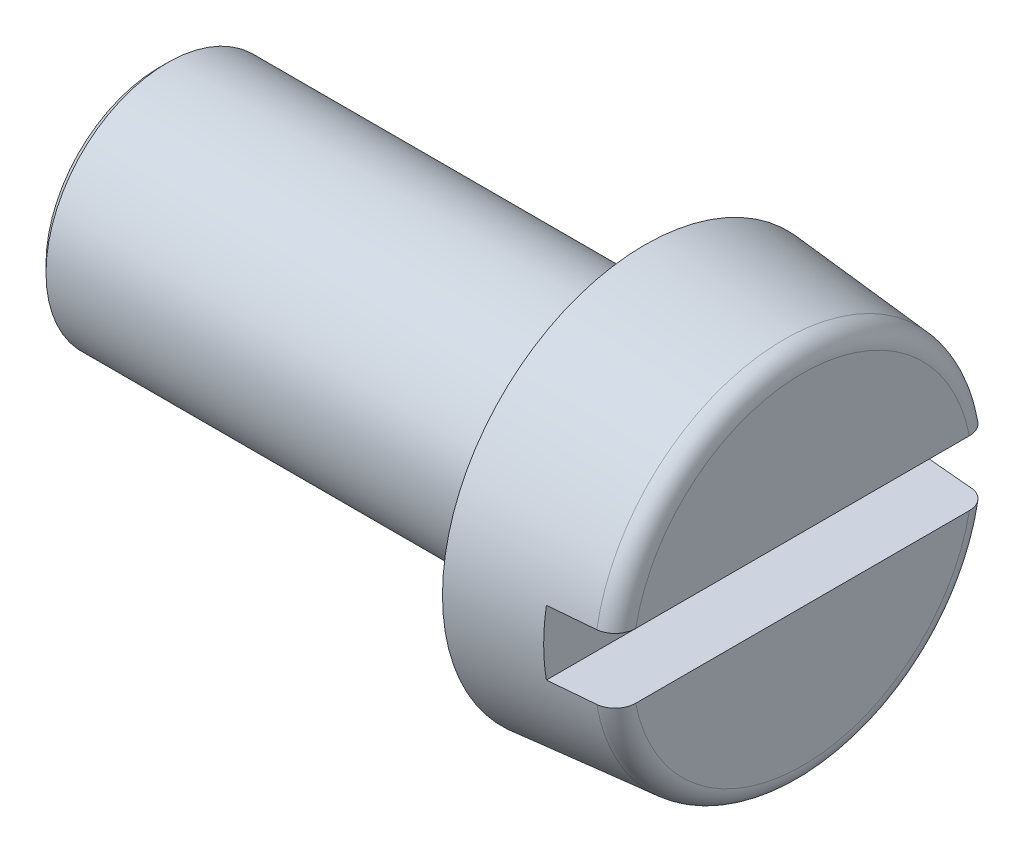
ISO-10303-21;
HEADER;
FILE_DESCRIPTION(('STEP AP214'),'2;1');
FILE_NAME('part.step','',(''),(''),'','','');
FILE_SCHEMA(('AUTOMOTIVE_DESIGN { 1 0 10303 214 1 1 1 1 }'));
ENDSEC;
DATA;
#1=APPLICATION_CONTEXT('core data for automotive mechanical design processes');
#2=APPLICATION_PROTOCOL_DEFINITION('international standard','automotive_design',2000,#1);
#3=PRODUCT_CONTEXT('',#1,'mechanical');
#4=PRODUCT('Part','Part','',(#3));
#5=PRODUCT_RELATED_PRODUCT_CATEGORY('part','',(#4));
#6=PRODUCT_DEFINITION_FORMATION('','',#4);
#7=PRODUCT_DEFINITION_CONTEXT('part definition',#1,'design');
#8=PRODUCT_DEFINITION('design','',#6,#7);
#9=PRODUCT_DEFINITION_SHAPE('','',#8);
#10=(LENGTH_UNIT() NAMED_UNIT(*) SI_UNIT(.MILLI.,.METRE.));
#11=(NAMED_UNIT(*) PLANE_ANGLE_UNIT() SI_UNIT($,.RADIAN.));
#12=(NAMED_UNIT(*) SI_UNIT($,.STERADIAN.) SOLID_ANGLE_UNIT());
#13=UNCERTAINTY_MEASURE_WITH_UNIT(LENGTH_MEASURE(1.E-05),#10,'distance_accuracy_value','');
#14=(GEOMETRIC_REPRESENTATION_CONTEXT(3) GLOBAL_UNCERTAINTY_ASSIGNED_CONTEXT((#13)) GLOBAL_UNIT_ASSIGNED_CONTEXT((#10,
#11,#12)) REPRESENTATION_CONTEXT('',''));
#15=CARTESIAN_POINT('',(0.,0.,0.));
#16=DIRECTION('',(0.,0.,1.));
#17=DIRECTION('',(1.,0.,0.));
#18=AXIS2_PLACEMENT_3D('',#15,#16,#17);
#19=CARTESIAN_POINT('',(3.9,0.,0.));
#20=DIRECTION('',(1.,0.,0.));
#21=DIRECTION('',(0.,0.,-1.));
#22=AXIS2_PLACEMENT_3D('',#19,#20,#21);
#23=PLANE('',#22);
#24=DIRECTION('',(0.,0.,1.));
#25=VECTOR('',#24,1.);
#26=CARTESIAN_POINT('',(3.9,0.799999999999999,-4.93558507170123));
#27=LINE('',#26,#25);
#28=CARTESIAN_POINT('',(3.9,0.799999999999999,-4.1237459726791));
#29=VERTEX_POINT('',#28);
#30=CARTESIAN_POINT('',(3.9,0.799999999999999,4.1237459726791));
#31=VERTEX_POINT('',#30);
#32=EDGE_CURVE('E171',#29,#31,#27,.T.);
#33=ORIENTED_EDGE('',*,*,#32,.F.);
#34=CARTESIAN_POINT('',(3.9,0.,0.));
#35=DIRECTION('',(-1.,0.,0.));
#36=DIRECTION('',(0.,0.,1.));
#37=AXIS2_PLACEMENT_3D('',#34,#35,#36);
#38=CIRCLE('',#37,4.20062862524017);
#39=EDGE_CURVE('E98',#31,#29,#38,.T.);
#40=ORIENTED_EDGE('',*,*,#39,.F.);
#41=EDGE_LOOP('',(#33,#40));
#42=FACE_BOUND('',#41,.T.);
#43=ADVANCED_FACE('F38',(#42),#23,.T.);
#44=CARTESIAN_POINT('',(3.4,0.,0.));
#45=DIRECTION('',(-1.,0.,0.));
#46=DIRECTION('',(0.,0.,1.));
#47=AXIS2_PLACEMENT_3D('',#44,#45,#46);
#48=TOROIDAL_SURFACE('',#47,4.20062862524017,0.5);
#49=CARTESIAN_POINT('',(3.52774679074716,0.799999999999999,-4.61521121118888));
#50=CARTESIAN_POINT('',(3.55476323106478,0.799999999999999,-4.60796387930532));
#51=CARTESIAN_POINT('',(3.58118338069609,0.799999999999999,-4.59841062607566));
#52=CARTESIAN_POINT('',(3.63205775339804,0.799999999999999,-4.57497961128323));
#53=CARTESIAN_POINT('',(3.65650938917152,0.799999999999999,-4.56109627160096));
#54=CARTESIAN_POINT('',(3.70271812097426,0.799999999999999,-4.52944340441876));
#55=CARTESIAN_POINT('',(3.72447787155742,0.799999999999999,-4.51167775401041));
#56=CARTESIAN_POINT('',(3.7647342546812,0.799999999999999,-4.47278291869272));
#57=CARTESIAN_POINT('',(3.78323165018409,0.799999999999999,-4.45165452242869));
#58=CARTESIAN_POINT('',(3.81665030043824,0.799999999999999,-4.40641898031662));
#59=CARTESIAN_POINT('',(3.83153509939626,0.799999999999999,-4.38228491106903));
#60=CARTESIAN_POINT('',(3.85711460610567,0.799999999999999,-4.33188938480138));
#61=CARTESIAN_POINT('',(3.86780881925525,0.799999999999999,-4.30562767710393));
#62=CARTESIAN_POINT('',(3.88487789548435,0.799999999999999,-4.25128228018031));
#63=CARTESIAN_POINT('',(3.89118229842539,0.799999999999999,-4.22317645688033));
#64=CARTESIAN_POINT('',(3.89904863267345,0.799999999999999,-4.16630862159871));
#65=CARTESIAN_POINT('',(3.90061019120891,0.799999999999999,-4.13754655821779));
#66=CARTESIAN_POINT('',(3.89895173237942,0.799999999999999,-4.07979276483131));
#67=CARTESIAN_POINT('',(3.89567054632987,0.799999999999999,-4.05080277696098));
#68=CARTESIAN_POINT('',(3.88430740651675,0.799999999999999,-3.99377829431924));
#69=CARTESIAN_POINT('',(3.87622525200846,0.799999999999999,-3.96574383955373));
#70=CARTESIAN_POINT('',(3.85543459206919,0.799999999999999,-3.91132710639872));
#71=CARTESIAN_POINT('',(3.84270933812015,0.799999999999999,-3.8849512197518));
#72=CARTESIAN_POINT('',(3.81297177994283,0.799999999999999,-3.83473620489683));
#73=CARTESIAN_POINT('',(3.7959595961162,0.799999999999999,-3.81089700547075));
#74=CARTESIAN_POINT('',(3.75828277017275,0.799999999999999,-3.76668673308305));
#75=CARTESIAN_POINT('',(3.73765369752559,0.799999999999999,-3.74628536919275));
#76=CARTESIAN_POINT('',(3.6932020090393,0.799999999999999,-3.7093212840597));
#77=CARTESIAN_POINT('',(3.66937975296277,0.799999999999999,-3.69275813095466));
#78=CARTESIAN_POINT('',(3.61972619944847,0.799999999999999,-3.66430195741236));
#79=CARTESIAN_POINT('',(3.59394475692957,0.799999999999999,-3.65232196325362));
#80=CARTESIAN_POINT('',(3.54070796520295,0.799999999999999,-3.6329662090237));
#81=CARTESIAN_POINT('',(3.51325284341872,0.799999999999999,-3.62558982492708));
#82=CARTESIAN_POINT('',(3.45806503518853,0.799999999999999,-3.61579596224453));
#83=CARTESIAN_POINT('',(3.43035013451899,0.799999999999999,-3.61327809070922));
#84=CARTESIAN_POINT('',(3.37489596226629,0.799999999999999,-3.6129804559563));
#85=CARTESIAN_POINT('',(3.34715669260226,0.799999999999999,-3.61520034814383));
#86=CARTESIAN_POINT('',(3.29271517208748,0.799999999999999,-3.62425978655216));
#87=CARTESIAN_POINT('',(3.26600559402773,0.799999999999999,-3.63105543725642));
#88=CARTESIAN_POINT('',(3.21409332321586,0.799999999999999,-3.64900145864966));
#89=CARTESIAN_POINT('',(3.18889066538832,0.799999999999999,-3.66015193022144));
#90=CARTESIAN_POINT('',(3.14049011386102,0.799999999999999,-3.68655958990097));
#91=CARTESIAN_POINT('',(3.11730892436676,0.799999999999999,-3.70184736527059));
#92=CARTESIAN_POINT('',(3.07377777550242,0.799999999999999,-3.73602702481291));
#93=CARTESIAN_POINT('',(3.05342807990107,0.799999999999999,-3.75491924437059));
#94=CARTESIAN_POINT('',(3.01570554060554,0.799999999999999,-3.7961662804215));
#95=CARTESIAN_POINT('',(2.99839942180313,0.799999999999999,-3.8185821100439));
#96=CARTESIAN_POINT('',(2.96770482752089,0.799999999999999,-3.86595197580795));
#97=CARTESIAN_POINT('',(2.95431679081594,0.799999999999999,-3.89090629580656));
#98=CARTESIAN_POINT('',(2.93155662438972,0.799999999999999,-3.94320276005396));
#99=CARTESIAN_POINT('',(2.92227362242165,0.799999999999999,-3.97058371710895));
#100=CARTESIAN_POINT('',(2.90837527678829,0.799999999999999,-4.02650622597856));
#101=CARTESIAN_POINT('',(2.90376028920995,0.799999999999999,-4.05504786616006));
#102=CARTESIAN_POINT('',(2.89929658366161,0.799999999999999,-4.11284197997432));
#103=CARTESIAN_POINT('',(2.89950473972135,0.799999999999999,-4.14209886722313));
#104=CARTESIAN_POINT('',(2.90483423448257,0.799999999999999,-4.20016284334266));
#105=CARTESIAN_POINT('',(2.90995564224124,0.799999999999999,-4.22896992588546));
#106=CARTESIAN_POINT('',(2.92498226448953,0.799999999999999,-4.2852766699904));
#107=CARTESIAN_POINT('',(2.93488232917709,0.799999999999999,-4.31277770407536));
#108=CARTESIAN_POINT('',(2.95921142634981,0.799999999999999,-4.36569898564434));
#109=CARTESIAN_POINT('',(2.97364023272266,0.799999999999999,-4.39111933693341));
#110=CARTESIAN_POINT('',(3.00644955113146,0.799999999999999,-4.4388398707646));
#111=CARTESIAN_POINT('',(3.0247829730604,0.799999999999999,-4.46117241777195));
#112=CARTESIAN_POINT('',(3.06499289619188,0.799999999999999,-4.50237965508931));
#113=CARTESIAN_POINT('',(3.08686895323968,0.799999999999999,-4.52125477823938));
#114=CARTESIAN_POINT('',(3.13316963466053,0.799999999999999,-4.55469350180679));
#115=CARTESIAN_POINT('',(3.15754817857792,0.799999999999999,-4.56932091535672));
#116=CARTESIAN_POINT('',(3.20844824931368,0.799999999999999,-4.59421207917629));
#117=CARTESIAN_POINT('',(3.23497014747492,0.799999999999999,-4.60447507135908));
#118=CARTESIAN_POINT('',(3.2890118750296,0.799999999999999,-4.62020471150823));
#119=CARTESIAN_POINT('',(3.31651363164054,0.799999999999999,-4.62573362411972));
#120=CARTESIAN_POINT('',(3.37203228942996,0.799999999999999,-4.63204846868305));
#121=CARTESIAN_POINT('',(3.40004847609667,0.799999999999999,-4.63284054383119));
#122=CARTESIAN_POINT('',(3.44476962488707,0.799999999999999,-4.63030564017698));
#123=CARTESIAN_POINT('',(3.46157366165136,0.799999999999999,-4.62848133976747));
#124=CARTESIAN_POINT('',(3.49490651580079,0.799999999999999,-4.62312194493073));
#125=CARTESIAN_POINT('',(3.51143533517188,0.799999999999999,-4.61958686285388));
#126=CARTESIAN_POINT('',(3.52774679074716,0.799999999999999,-4.61521121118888));
#127=B_SPLINE_CURVE_WITH_KNOTS('',3,(#49,#50,#51,#52,#53,#54,#55,#56,#57,#58,#59,#60,#61,#62,
#63,#64,#65,#66,#67,#68,#69,#70,#71,#72,#73,#74,#75,#76,#77,#78,#79,#80,#81,#82,#83,#84,#85,#86,
#87,#88,#89,#90,#91,#92,#93,#94,#95,#96,#97,#98,#99,#100,#101,#102,#103,#104,#105,#106,#107,
#108,#109,#110,#111,#112,#113,#114,#115,#116,#117,#118,#119,#120,#121,#122,#123,#124,#125,#126),
.UNSPECIFIED.,.T.,.F.,(4,2,2,2,2,2,2,2,2,2,2,2,2,2,2,2,2,2,2,2,2,2,2,2,2,2,2,2,2,2,2,2,2,2,2,2,
2,2,4),(0.,0.0838523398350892,0.167813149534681,0.251690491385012,0.335548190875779,
0.42021988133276,0.504901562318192,0.590912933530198,0.676931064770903,0.76404503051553,
0.851162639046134,0.938597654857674,1.02603021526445,1.11264678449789,1.19925360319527,
1.28412404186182,1.36898297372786,1.45206883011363,1.53514864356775,1.61744261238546,
1.69973848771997,1.78266023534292,1.86558970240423,1.95015690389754,2.03473357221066,
2.12106582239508,2.20740465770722,2.29476210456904,2.38212077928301,2.46938551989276,
2.55664590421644,2.64290814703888,2.72915958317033,2.8140388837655,2.89893292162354,
2.9826924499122,3.06634332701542,3.11697041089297,3.16759712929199),.UNSPECIFIED.);
#128=CARTESIAN_POINT('',(3.44357787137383,0.799999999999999,-4.63012157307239));
#129=VERTEX_POINT('',#128);
#130=EDGE_CURVE('E150',#129,#29,#127,.T.);
#131=ORIENTED_EDGE('',*,*,#130,.F.);
#132=CARTESIAN_POINT('',(3.44357787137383,0.,0.));
#133=DIRECTION('',(-1.,0.,0.));
#134=DIRECTION('',(0.,0.,1.));
#135=AXIS2_PLACEMENT_3D('',#132,#133,#134);
#136=CIRCLE('',#135,4.69872597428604);
#137=CARTESIAN_POINT('',(3.44357787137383,0.799999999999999,4.63012157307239));
#138=VERTEX_POINT('',#137);
#139=EDGE_CURVE('E110',#138,#129,#136,.T.);
#140=ORIENTED_EDGE('',*,*,#139,.F.);
#141=CARTESIAN_POINT('',(3.57254162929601,0.799999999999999,3.64457370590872));
#142=CARTESIAN_POINT('',(3.59887173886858,0.799999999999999,3.65448642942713));
#143=CARTESIAN_POINT('',(3.62437233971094,0.799999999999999,3.66666727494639));
#144=CARTESIAN_POINT('',(3.67297144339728,0.799999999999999,3.69517294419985));
#145=CARTESIAN_POINT('',(3.69606647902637,0.799999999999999,3.7115036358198));
#146=CARTESIAN_POINT('',(3.73917258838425,0.799999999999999,3.74776920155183));
#147=CARTESIAN_POINT('',(3.75918795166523,0.799999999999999,3.76769897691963));
#148=CARTESIAN_POINT('',(3.79564709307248,0.799999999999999,3.81058128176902));
#149=CARTESIAN_POINT('',(3.81209170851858,0.799999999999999,3.83353310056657));
#150=CARTESIAN_POINT('',(3.841239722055,0.799999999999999,3.88220655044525));
#151=CARTESIAN_POINT('',(3.85387844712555,0.799999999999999,3.9079669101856));
#152=CARTESIAN_POINT('',(3.87473194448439,0.799999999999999,3.96122161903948));
#153=CARTESIAN_POINT('',(3.88294611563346,0.799999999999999,3.98871620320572));
#154=CARTESIAN_POINT('',(3.89483524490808,0.799999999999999,4.04513673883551));
#155=CARTESIAN_POINT('',(3.8984345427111,0.799999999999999,4.07407865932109));
#156=CARTESIAN_POINT('',(3.90074513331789,0.799999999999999,4.13215790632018));
#157=CARTESIAN_POINT('',(3.89945623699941,0.799999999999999,4.16129524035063));
#158=CARTESIAN_POINT('',(3.89199648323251,0.799999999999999,4.21905741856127));
#159=CARTESIAN_POINT('',(3.88580628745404,0.799999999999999,4.24767977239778));
#160=CARTESIAN_POINT('',(3.86866992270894,0.799999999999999,4.30346465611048));
#161=CARTESIAN_POINT('',(3.85772390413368,0.799999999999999,4.33062723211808));
#162=CARTESIAN_POINT('',(3.8314661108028,0.799999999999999,4.38248106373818));
#163=CARTESIAN_POINT('',(3.81619000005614,0.799999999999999,4.40719036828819));
#164=CARTESIAN_POINT('',(3.7816471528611,0.799999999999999,4.45364265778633));
#165=CARTESIAN_POINT('',(3.76238071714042,0.799999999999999,4.47538586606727));
#166=CARTESIAN_POINT('',(3.72070968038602,0.799999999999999,4.51493993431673));
#167=CARTESIAN_POINT('',(3.69835612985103,0.799999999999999,4.53280457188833));
#168=CARTESIAN_POINT('',(3.65092834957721,0.799999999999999,4.56445799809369));
#169=CARTESIAN_POINT('',(3.62585436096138,0.799999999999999,4.57824714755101));
#170=CARTESIAN_POINT('',(3.57411063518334,0.799999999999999,4.60114111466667));
#171=CARTESIAN_POINT('',(3.54747112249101,0.799999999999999,4.61031426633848));
#172=CARTESIAN_POINT('',(3.49302178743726,0.799999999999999,4.62400554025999));
#173=CARTESIAN_POINT('',(3.46521204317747,0.799999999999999,4.62852397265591));
#174=CARTESIAN_POINT('',(3.40951842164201,0.799999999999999,4.63274323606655));
#175=CARTESIAN_POINT('',(3.38163825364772,0.799999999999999,4.63249317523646));
#176=CARTESIAN_POINT('',(3.32631848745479,0.799999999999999,4.62730376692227));
#177=CARTESIAN_POINT('',(3.2988788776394,0.799999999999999,4.62236454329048));
#178=CARTESIAN_POINT('',(3.24528128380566,0.799999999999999,4.60796494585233));
#179=CARTESIAN_POINT('',(3.21912051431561,0.799999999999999,4.5985149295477));
#180=CARTESIAN_POINT('',(3.16874300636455,0.799999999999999,4.57538334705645));
#181=CARTESIAN_POINT('',(3.14452630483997,0.799999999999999,4.56170170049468));
#182=CARTESIAN_POINT('',(3.09855525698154,0.799999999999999,4.53041481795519));
#183=CARTESIAN_POINT('',(3.07681721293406,0.799999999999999,4.512785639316));
#184=CARTESIAN_POINT('',(3.03656263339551,0.799999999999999,4.47417039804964));
#185=CARTESIAN_POINT('',(3.01804628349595,0.799999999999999,4.45318414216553));
#186=CARTESIAN_POINT('',(2.98450007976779,0.799999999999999,4.40816439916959));
#187=CARTESIAN_POINT('',(2.96951842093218,0.799999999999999,4.38409500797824));
#188=CARTESIAN_POINT('',(2.94373654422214,0.799999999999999,4.33381286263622));
#189=CARTESIAN_POINT('',(2.93293666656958,0.799999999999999,4.30759993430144));
#190=CARTESIAN_POINT('',(2.91564798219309,0.799999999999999,4.25333499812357));
#191=CARTESIAN_POINT('',(2.90922948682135,0.799999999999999,4.22526058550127));
#192=CARTESIAN_POINT('',(2.9011309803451,0.799999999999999,4.16843628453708));
#193=CARTESIAN_POINT('',(2.89945134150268,0.799999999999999,4.13968634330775));
#194=CARTESIAN_POINT('',(2.90087111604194,0.799999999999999,4.08193499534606));
#195=CARTESIAN_POINT('',(2.904032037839,0.799999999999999,4.05293508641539));
#196=CARTESIAN_POINT('',(2.91515729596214,0.799999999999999,3.99587047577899));
#197=CARTESIAN_POINT('',(2.9231218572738,0.799999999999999,3.96780581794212));
#198=CARTESIAN_POINT('',(2.94368405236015,0.799999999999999,3.91330487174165));
#199=CARTESIAN_POINT('',(2.9562991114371,0.799999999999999,3.88687515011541));
#200=CARTESIAN_POINT('',(2.98582628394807,0.799999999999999,3.83653405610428));
#201=CARTESIAN_POINT('',(3.00273828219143,0.799999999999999,3.81262261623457));
#202=CARTESIAN_POINT('',(3.04023203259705,0.799999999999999,3.76824762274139));
#203=CARTESIAN_POINT('',(3.06077878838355,0.799999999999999,3.74775452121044));
#204=CARTESIAN_POINT('',(3.10508176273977,0.799999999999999,3.71059463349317));
#205=CARTESIAN_POINT('',(3.12883749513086,0.799999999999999,3.69392726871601));
#206=CARTESIAN_POINT('',(3.17837722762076,0.799999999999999,3.6652547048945));
#207=CARTESIAN_POINT('',(3.20411094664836,0.799999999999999,3.65316264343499));
#208=CARTESIAN_POINT('',(3.25727993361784,0.799999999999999,3.63357362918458));
#209=CARTESIAN_POINT('',(3.28471541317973,0.799999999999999,3.62607724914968));
#210=CARTESIAN_POINT('',(3.33989411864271,0.799999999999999,3.61604269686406));
#211=CARTESIAN_POINT('',(3.36761954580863,0.799999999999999,3.61340616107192));
#212=CARTESIAN_POINT('',(3.42309040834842,0.799999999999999,3.6128824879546));
#213=CARTESIAN_POINT('',(3.45083576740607,0.799999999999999,3.61498900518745));
#214=CARTESIAN_POINT('',(3.49427910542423,0.799999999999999,3.62203012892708));
#215=CARTESIAN_POINT('',(3.5102385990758,0.799999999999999,3.62544520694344));
#216=CARTESIAN_POINT('',(3.54173883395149,0.799999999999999,3.63384409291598));
#217=CARTESIAN_POINT('',(3.55727958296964,0.799999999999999,3.63882787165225));
#218=CARTESIAN_POINT('',(3.57254162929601,0.799999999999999,3.64457370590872));
#219=B_SPLINE_CURVE_WITH_KNOTS('',3,(#141,#142,#143,#144,#145,#146,#147,#148,#149,#150,#151,
#152,#153,#154,#155,#156,#157,#158,#159,#160,#161,#162,#163,#164,#165,#166,#167,#168,#169,#170,
#171,#172,#173,#174,#175,#176,#177,#178,#179,#180,#181,#182,#183,#184,#185,#186,#187,#188,#189,
#190,#191,#192,#193,#194,#195,#196,#197,#198,#199,#200,#201,#202,#203,#204,#205,#206,#207,#208,
#209,#210,#211,#212,#213,#214,#215,#216,#217,#218),.UNSPECIFIED.,.T.,.F.,(4,2,2,2,2,2,2,2,2,2,2,
2,2,2,2,2,2,2,2,2,2,2,2,2,2,2,2,2,2,2,2,2,2,2,2,2,2,2,4),(0.,0.0843416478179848,
0.168803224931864,0.253146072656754,0.337469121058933,0.423153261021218,0.508849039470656,
0.59593254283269,0.683019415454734,0.770451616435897,0.857881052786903,0.944610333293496,
1.03133307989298,1.11676331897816,1.20218599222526,1.28630387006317,1.37041614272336,
1.45366266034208,1.53690697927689,1.61996106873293,1.70301673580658,1.78659049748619,
1.8701690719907,1.95482871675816,2.0394952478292,2.12549041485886,2.21149233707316,
2.29859617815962,2.38570409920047,2.47314178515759,2.56057712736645,2.64721238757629,
2.73383453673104,2.81871803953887,2.90361211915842,2.98676823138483,3.06981316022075,
3.1187020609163,3.16759005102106),.UNSPECIFIED.);
#220=EDGE_CURVE('E146',#31,#138,#219,.T.);
#221=ORIENTED_EDGE('',*,*,#220,.F.);
#222=ORIENTED_EDGE('',*,*,#39,.T.);
#223=EDGE_LOOP('',(#131,#140,#221,#222));
#224=FACE_BOUND('',#223,.T.);
#225=ADVANCED_FACE('F164',(#224),#48,.T.);
#226=CARTESIAN_POINT('',(-12.,0.,0.));
#227=DIRECTION('',(-1.,0.,0.));
#228=DIRECTION('',(0.,0.,1.));
#229=AXIS2_PLACEMENT_3D('',#226,#227,#228);
#230=PLANE('',#229);
#231=CARTESIAN_POINT('',(-12.,0.,0.));
#232=DIRECTION('',(-1.,0.,0.));
#233=DIRECTION('',(0.,0.,1.));
#234=AXIS2_PLACEMENT_3D('',#231,#232,#233);
#235=CIRCLE('',#234,2.8);
#236=CARTESIAN_POINT('',(-12.,0.,2.8));
#237=VERTEX_POINT('',#236);
#238=EDGE_CURVE('E46',#237,#237,#235,.T.);
#239=ORIENTED_EDGE('',*,*,#238,.T.);
#240=EDGE_LOOP('',(#239));
#241=FACE_BOUND('',#240,.T.);
#242=ADVANCED_FACE('F205',(#241),#230,.T.);
#243=DIRECTION('',(0.,0.,-1.));
#244=VECTOR('',#243,1.);
#245=CARTESIAN_POINT('',(3.9,-0.799999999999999,-4.93558507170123));
#246=LINE('',#245,#244);
#247=CARTESIAN_POINT('',(3.9,-0.799999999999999,4.1237459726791));
#248=VERTEX_POINT('',#247);
#249=CARTESIAN_POINT('',(3.9,-0.799999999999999,-4.1237459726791));
#250=VERTEX_POINT('',#249);
#251=EDGE_CURVE('E173',#248,#250,#246,.T.);
#252=ORIENTED_EDGE('',*,*,#251,.F.);
#253=EDGE_CURVE('E183',#250,#248,#38,.T.);
#254=ORIENTED_EDGE('',*,*,#253,.F.);
#255=EDGE_LOOP('',(#252,#254));
#256=FACE_BOUND('',#255,.T.);
#257=ADVANCED_FACE('F162',(#256),#23,.T.);
#258=CARTESIAN_POINT('',(3.52774679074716,-0.799999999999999,-4.61521121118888));
#259=CARTESIAN_POINT('',(3.50099032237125,-0.799999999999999,-4.62238614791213));
#260=CARTESIAN_POINT('',(3.47361002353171,-0.799999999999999,-4.62731007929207));
#261=CARTESIAN_POINT('',(3.41838965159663,-0.799999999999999,-4.63249095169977));
#262=CARTESIAN_POINT('',(3.39054909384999,-0.799999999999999,-4.63274261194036));
#263=CARTESIAN_POINT('',(3.33523292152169,-0.799999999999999,-4.62856339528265));
#264=CARTESIAN_POINT('',(3.30775713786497,-0.799999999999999,-4.62413477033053));
#265=CARTESIAN_POINT('',(3.25394492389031,-0.799999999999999,-4.61073430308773));
#266=CARTESIAN_POINT('',(3.22760823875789,-0.799999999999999,-4.60176348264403));
#267=CARTESIAN_POINT('',(3.17676498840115,-0.799999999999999,-4.57953399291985));
#268=CARTESIAN_POINT('',(3.15226124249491,-0.799999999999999,-4.5662688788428));
#269=CARTESIAN_POINT('',(3.1058001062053,-0.799999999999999,-4.53584968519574));
#270=CARTESIAN_POINT('',(3.08384289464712,-0.799999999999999,-4.51869533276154));
#271=CARTESIAN_POINT('',(3.04286738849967,-0.799999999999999,-4.48081729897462));
#272=CARTESIAN_POINT('',(3.02387921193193,-0.799999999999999,-4.4600610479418));
#273=CARTESIAN_POINT('',(2.98959651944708,-0.799999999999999,-4.41569543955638));
#274=CARTESIAN_POINT('',(2.97430226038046,-0.799999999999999,-4.39208588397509));
#275=CARTESIAN_POINT('',(2.94759880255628,-0.799999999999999,-4.34231282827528));
#276=CARTESIAN_POINT('',(2.93625031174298,-0.799999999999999,-4.31611676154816));
#277=CARTESIAN_POINT('',(2.91803806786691,-0.799999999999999,-4.26220983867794));
#278=CARTESIAN_POINT('',(2.91117468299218,-0.799999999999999,-4.23449885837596));
#279=CARTESIAN_POINT('',(2.90202547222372,-0.799999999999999,-4.17789889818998));
#280=CARTESIAN_POINT('',(2.89981070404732,-0.799999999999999,-4.14899842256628));
#281=CARTESIAN_POINT('',(2.90021471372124,-0.799999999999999,-4.09123061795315));
#282=CARTESIAN_POINT('',(2.90283382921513,-0.799999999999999,-4.06236329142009));
#283=CARTESIAN_POINT('',(2.91287824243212,-0.799999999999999,-4.00519288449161));
#284=CARTESIAN_POINT('',(2.92034896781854,-0.799999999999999,-3.97689777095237));
#285=CARTESIAN_POINT('',(2.93994192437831,-0.799999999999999,-3.92196499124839));
#286=CARTESIAN_POINT('',(2.95206423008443,-0.799999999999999,-3.8953273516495));
#287=CARTESIAN_POINT('',(2.9806162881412,-0.799999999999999,-3.84453035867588));
#288=CARTESIAN_POINT('',(2.99703835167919,-0.799999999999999,-3.82036668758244));
#289=CARTESIAN_POINT('',(3.03376229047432,-0.799999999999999,-3.77519120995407));
#290=CARTESIAN_POINT('',(3.0540639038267,-0.799999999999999,-3.7541791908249));
#291=CARTESIAN_POINT('',(3.0976625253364,-0.799999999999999,-3.7162493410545));
#292=CARTESIAN_POINT('',(3.12091100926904,-0.799999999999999,-3.69927576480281));
#293=CARTESIAN_POINT('',(3.16997955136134,-0.799999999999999,-3.66957601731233));
#294=CARTESIAN_POINT('',(3.19579926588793,-0.799999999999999,-3.65684927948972));
#295=CARTESIAN_POINT('',(3.2486682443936,-0.799999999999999,-3.63629906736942));
#296=CARTESIAN_POINT('',(3.27567803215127,-0.799999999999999,-3.62837401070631));
#297=CARTESIAN_POINT('',(3.33065452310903,-0.799999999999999,-3.61726052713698));
#298=CARTESIAN_POINT('',(3.35862111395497,-0.799999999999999,-3.61407154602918));
#299=CARTESIAN_POINT('',(3.41420126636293,-0.799999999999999,-3.61255111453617));
#300=CARTESIAN_POINT('',(3.44181259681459,-0.799999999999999,-3.61413682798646));
#301=CARTESIAN_POINT('',(3.49637305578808,-0.799999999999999,-3.62193331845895));
#302=CARTESIAN_POINT('',(3.52332220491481,-0.799999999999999,-3.62814395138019));
#303=CARTESIAN_POINT('',(3.57574315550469,-0.799999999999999,-3.64496925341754));
#304=CARTESIAN_POINT('',(3.60121797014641,-0.799999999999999,-3.65557455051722));
#305=CARTESIAN_POINT('',(3.65006007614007,-0.799999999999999,-3.68085418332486));
#306=CARTESIAN_POINT('',(3.67342724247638,-0.799999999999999,-3.69552876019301));
#307=CARTESIAN_POINT('',(3.71775058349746,-0.799999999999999,-3.72873617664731));
#308=CARTESIAN_POINT('',(3.73866841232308,-0.799999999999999,-3.74732016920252));
#309=CARTESIAN_POINT('',(3.77716927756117,-0.799999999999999,-3.78766909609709));
#310=CARTESIAN_POINT('',(3.79475195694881,-0.799999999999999,-3.80943437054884));
#311=CARTESIAN_POINT('',(3.82648503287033,-0.799999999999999,-3.85603286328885));
#312=CARTESIAN_POINT('',(3.84055290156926,-0.799999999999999,-3.88092228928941));
#313=CARTESIAN_POINT('',(3.86439554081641,-0.799999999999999,-3.93267899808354));
#314=CARTESIAN_POINT('',(3.87416986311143,-0.799999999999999,-3.95954648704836));
#315=CARTESIAN_POINT('',(3.88931250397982,-0.799999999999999,-4.01501171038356));
#316=CARTESIAN_POINT('',(3.89459928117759,-0.799999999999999,-4.04363173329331));
#317=CARTESIAN_POINT('',(3.90032690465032,-0.799999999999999,-4.10135353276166));
#318=CARTESIAN_POINT('',(3.90076749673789,-0.799999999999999,-4.1304553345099));
#319=CARTESIAN_POINT('',(3.89676729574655,-0.799999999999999,-4.1885076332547));
#320=CARTESIAN_POINT('',(3.89229571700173,-0.799999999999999,-4.21745602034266));
#321=CARTESIAN_POINT('',(3.87852610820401,-0.799999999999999,-4.2741813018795));
#322=CARTESIAN_POINT('',(3.86922834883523,-0.799999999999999,-4.30195826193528));
#323=CARTESIAN_POINT('',(3.84611660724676,-0.799999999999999,-4.35535923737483));
#324=CARTESIAN_POINT('',(3.83233133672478,-0.799999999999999,-4.38099567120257));
#325=CARTESIAN_POINT('',(3.80058918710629,-0.799999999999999,-4.42955223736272));
#326=CARTESIAN_POINT('',(3.78263155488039,-0.799999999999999,-4.45247187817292));
#327=CARTESIAN_POINT('',(3.74331906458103,-0.799999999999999,-4.49459451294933));
#328=CARTESIAN_POINT('',(3.7220140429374,-0.799999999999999,-4.51384406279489));
#329=CARTESIAN_POINT('',(3.67644628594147,-0.799999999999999,-4.54840423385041));
#330=CARTESIAN_POINT('',(3.65218748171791,-0.799999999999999,-4.56372000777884));
#331=CARTESIAN_POINT('',(3.6110486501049,-0.799999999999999,-4.58498032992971));
#332=CARTESIAN_POINT('',(3.59485273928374,-0.799999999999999,-4.59227738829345));
#333=CARTESIAN_POINT('',(3.56177215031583,-0.799999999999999,-4.60509462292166));
#334=CARTESIAN_POINT('',(3.54488747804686,-0.799999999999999,-4.61061481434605));
#335=CARTESIAN_POINT('',(3.52774679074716,-0.799999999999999,-4.61521121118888));
#336=B_SPLINE_CURVE_WITH_KNOTS('',3,(#258,#259,#260,#261,#262,#263,#264,#265,#266,#267,#268,
#269,#270,#271,#272,#273,#274,#275,#276,#277,#278,#279,#280,#281,#282,#283,#284,#285,#286,#287,
#288,#289,#290,#291,#292,#293,#294,#295,#296,#297,#298,#299,#300,#301,#302,#303,#304,#305,#306,
#307,#308,#309,#310,#311,#312,#313,#314,#315,#316,#317,#318,#319,#320,#321,#322,#323,#324,#325,
#326,#327,#328,#329,#330,#331,#332,#333,#334,#335),.UNSPECIFIED.,.T.,.F.,(4,2,2,2,2,2,2,2,2,2,2,
2,2,2,2,2,2,2,2,2,2,2,2,2,2,2,2,2,2,2,2,2,2,2,2,2,2,2,4),(0.,0.0830406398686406,
0.166175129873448,0.249269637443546,0.332345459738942,0.415546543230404,0.498753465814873,
0.582756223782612,0.666764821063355,0.752014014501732,0.837270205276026,0.9238203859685,
1.01037661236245,1.09775521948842,1.18513522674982,1.27236003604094,1.35957895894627,
1.44551321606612,1.5314360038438,1.6154710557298,1.69949627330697,1.78207218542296,
1.86464552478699,1.94704366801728,2.02944669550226,2.11300368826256,2.19656962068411,
2.28194430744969,2.36732790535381,2.45423164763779,2.54113994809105,2.62859604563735,
2.71604723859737,2.80294955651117,2.88986757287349,2.97559651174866,3.06121257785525,
3.1144103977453,3.1676077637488),.UNSPECIFIED.);
#337=CARTESIAN_POINT('',(3.44357787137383,-0.799999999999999,-4.63012157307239));
#338=VERTEX_POINT('',#337);
#339=EDGE_CURVE('E151',#250,#338,#336,.T.);
#340=ORIENTED_EDGE('',*,*,#339,.F.);
#341=ORIENTED_EDGE('',*,*,#253,.T.);
#342=CARTESIAN_POINT('',(3.57254162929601,-0.799999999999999,3.64457370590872));
#343=CARTESIAN_POINT('',(3.54681043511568,-0.799999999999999,3.63488921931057));
#344=CARTESIAN_POINT('',(3.52024994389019,-0.799999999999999,3.62735628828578));
#345=CARTESIAN_POINT('',(3.46622154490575,-0.799999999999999,3.6168515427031));
#346=CARTESIAN_POINT('',(3.43875274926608,-0.799999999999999,3.61388433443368));
#347=CARTESIAN_POINT('',(3.38371295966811,-0.799999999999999,3.61261861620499));
#348=CARTESIAN_POINT('',(3.35614199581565,-0.799999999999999,3.61431882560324));
#349=CARTESIAN_POINT('',(3.30168539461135,-0.799999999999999,3.62232941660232));
#350=CARTESIAN_POINT('',(3.27479962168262,-0.799999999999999,3.62863887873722));
#351=CARTESIAN_POINT('',(3.22247925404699,-0.799999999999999,3.6456553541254));
#352=CARTESIAN_POINT('',(3.19704371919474,-0.799999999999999,3.65635948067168));
#353=CARTESIAN_POINT('',(3.14829501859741,-0.799999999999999,3.68182860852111));
#354=CARTESIAN_POINT('',(3.12498203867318,-0.799999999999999,3.69659396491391));
#355=CARTESIAN_POINT('',(3.08077859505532,-0.799999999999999,3.72997568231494));
#356=CARTESIAN_POINT('',(3.05992703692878,-0.799999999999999,3.7486435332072));
#357=CARTESIAN_POINT('',(3.0215714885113,-0.799999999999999,3.78914810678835));
#358=CARTESIAN_POINT('',(3.00406785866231,-0.799999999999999,3.81098517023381));
#359=CARTESIAN_POINT('',(2.97250506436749,-0.799999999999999,3.85771538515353));
#360=CARTESIAN_POINT('',(2.95852874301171,-0.799999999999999,3.88266449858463));
#361=CARTESIAN_POINT('',(2.93487829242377,-0.799999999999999,3.93452476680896));
#362=CARTESIAN_POINT('',(2.92520459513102,-0.799999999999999,3.96143611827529));
#363=CARTESIAN_POINT('',(2.91027244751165,-0.799999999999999,4.01697002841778));
#364=CARTESIAN_POINT('',(2.9050951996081,-0.799999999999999,4.04561444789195));
#365=CARTESIAN_POINT('',(2.89958994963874,-0.799999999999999,4.10336643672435));
#366=CARTESIAN_POINT('',(2.899262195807,-0.799999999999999,4.13247402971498));
#367=CARTESIAN_POINT('',(2.9034889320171,-0.799999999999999,4.19051385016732));
#368=CARTESIAN_POINT('',(2.9080733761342,-0.799999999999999,4.21944390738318));
#369=CARTESIAN_POINT('',(2.92206474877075,-0.799999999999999,4.27611460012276));
#370=CARTESIAN_POINT('',(2.93147158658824,-0.799999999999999,4.30385525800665));
#371=CARTESIAN_POINT('',(2.95479388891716,-0.799999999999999,4.35716500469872));
#372=CARTESIAN_POINT('',(2.96868059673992,-0.799999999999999,4.38274666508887));
#373=CARTESIAN_POINT('',(3.00061076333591,-0.799999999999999,4.43117023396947));
#374=CARTESIAN_POINT('',(3.01865392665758,-0.799999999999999,4.4540123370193));
#375=CARTESIAN_POINT('',(3.05811375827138,-0.799999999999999,4.4959573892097));
#376=CARTESIAN_POINT('',(3.07947881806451,-0.799999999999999,4.5151088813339));
#377=CARTESIAN_POINT('',(3.12516471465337,-0.799999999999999,4.54948436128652));
#378=CARTESIAN_POINT('',(3.14948528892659,-0.799999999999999,4.56470869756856));
#379=CARTESIAN_POINT('',(3.19998179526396,-0.799999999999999,4.59054964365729));
#380=CARTESIAN_POINT('',(3.22612277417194,-0.799999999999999,4.60123457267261));
#381=CARTESIAN_POINT('',(3.27984018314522,-0.799999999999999,4.61800664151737));
#382=CARTESIAN_POINT('',(3.30741650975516,-0.799999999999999,4.62409411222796));
#383=CARTESIAN_POINT('',(3.36288442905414,-0.799999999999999,4.63143898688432));
#384=CARTESIAN_POINT('',(3.39076885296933,-0.799999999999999,4.63275061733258));
#385=CARTESIAN_POINT('',(3.44635913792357,-0.799999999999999,4.63065450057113));
#386=CARTESIAN_POINT('',(3.47406500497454,-0.799999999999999,4.62724691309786));
#387=CARTESIAN_POINT('',(3.5284059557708,-0.799999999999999,4.61583884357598));
#388=CARTESIAN_POINT('',(3.5550446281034,-0.799999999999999,4.60785543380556));
#389=CARTESIAN_POINT('',(3.6066130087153,-0.799999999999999,4.58755080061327));
#390=CARTESIAN_POINT('',(3.63154269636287,-0.799999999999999,4.57522952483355));
#391=CARTESIAN_POINT('',(3.67912350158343,-0.799999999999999,4.54654627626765));
#392=CARTESIAN_POINT('',(3.70176285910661,-0.799999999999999,4.53016480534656));
#393=CARTESIAN_POINT('',(3.74401110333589,-0.799999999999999,4.49387533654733));
#394=CARTESIAN_POINT('',(3.76361983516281,-0.799999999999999,4.47396715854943));
#395=CARTESIAN_POINT('',(3.79950830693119,-0.799999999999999,4.43093813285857));
#396=CARTESIAN_POINT('',(3.8157450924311,-0.799999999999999,4.40778146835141));
#397=CARTESIAN_POINT('',(3.84417011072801,-0.799999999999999,4.35910468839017));
#398=CARTESIAN_POINT('',(3.85635801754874,-0.799999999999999,4.33358438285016));
#399=CARTESIAN_POINT('',(3.87653990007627,-0.799999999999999,4.28047982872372));
#400=CARTESIAN_POINT('',(3.88446554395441,-0.799999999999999,4.25286960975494));
#401=CARTESIAN_POINT('',(3.89563875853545,-0.799999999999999,4.19671823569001));
#402=CARTESIAN_POINT('',(3.89888593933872,-0.799999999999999,4.16817700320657));
#403=CARTESIAN_POINT('',(3.90064367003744,-0.799999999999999,4.11055557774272));
#404=CARTESIAN_POINT('',(3.89908852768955,-0.799999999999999,4.08147336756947));
#405=CARTESIAN_POINT('',(3.89114784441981,-0.799999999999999,4.02397608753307));
#406=CARTESIAN_POINT('',(3.88476222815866,-0.799999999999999,3.99556102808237));
#407=CARTESIAN_POINT('',(3.86728172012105,-0.799999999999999,3.94004328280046));
#408=CARTESIAN_POINT('',(3.85616090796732,-0.799999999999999,3.91294874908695));
#409=CARTESIAN_POINT('',(3.82949451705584,-0.799999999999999,3.86102108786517));
#410=CARTESIAN_POINT('',(3.81394790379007,-0.799999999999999,3.83618849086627));
#411=CARTESIAN_POINT('',(3.77896308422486,-0.799999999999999,3.78968938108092));
#412=CARTESIAN_POINT('',(3.75955079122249,-0.799999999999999,3.76800336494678));
#413=CARTESIAN_POINT('',(3.71731279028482,-0.799999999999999,3.72829609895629));
#414=CARTESIAN_POINT('',(3.69449162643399,-0.799999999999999,3.71027004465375));
#415=CARTESIAN_POINT('',(3.65498781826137,-0.799999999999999,3.68429389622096));
#416=CARTESIAN_POINT('',(3.63912545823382,-0.799999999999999,3.67507364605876));
#417=CARTESIAN_POINT('',(3.60647877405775,-0.799999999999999,3.65844148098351));
#418=CARTESIAN_POINT('',(3.58969446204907,-0.799999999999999,3.65102954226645));
#419=CARTESIAN_POINT('',(3.57254162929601,-0.799999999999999,3.64457370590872));
#420=B_SPLINE_CURVE_WITH_KNOTS('',3,(#342,#343,#344,#345,#346,#347,#348,#349,#350,#351,#352,
#353,#354,#355,#356,#357,#358,#359,#360,#361,#362,#363,#364,#365,#366,#367,#368,#369,#370,#371,
#372,#373,#374,#375,#376,#377,#378,#379,#380,#381,#382,#383,#384,#385,#386,#387,#388,#389,#390,
#391,#392,#393,#394,#395,#396,#397,#398,#399,#400,#401,#402,#403,#404,#405,#406,#407,#408,#409,
#410,#411,#412,#413,#414,#415,#416,#417,#418,#419),.UNSPECIFIED.,.T.,.F.,(4,2,2,2,2,2,2,2,2,2,2,
2,2,2,2,2,2,2,2,2,2,2,2,2,2,2,2,2,2,2,2,2,2,2,2,2,2,2,4),(0.,0.0824138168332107,
0.164910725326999,0.247385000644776,0.329842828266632,0.412246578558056,0.494657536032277,
0.578233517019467,0.661818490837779,0.747214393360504,0.832618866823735,0.919535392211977,
1.00645636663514,1.09391040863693,1.18136280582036,1.26826465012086,1.3551603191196,
1.44082058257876,1.52647324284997,1.61078674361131,1.69509417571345,1.77844131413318,
1.8617856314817,1.94482099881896,2.02785736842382,2.11130050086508,2.1947478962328,
2.2792006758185,2.36366025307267,2.44943630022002,2.53521949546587,2.62218131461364,
2.70914449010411,2.79658994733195,2.88405586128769,2.97095407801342,3.0577374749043,
3.11267658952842,3.16761498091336),.UNSPECIFIED.);
#421=CARTESIAN_POINT('',(3.44357787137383,-0.799999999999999,4.63012157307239));
#422=VERTEX_POINT('',#421);
#423=EDGE_CURVE('E104',#422,#248,#420,.T.);
#424=ORIENTED_EDGE('',*,*,#423,.F.);
#425=EDGE_CURVE('E185',#338,#422,#136,.T.);
#426=ORIENTED_EDGE('',*,*,#425,.F.);
#427=EDGE_LOOP('',(#340,#341,#424,#426));
#428=FACE_BOUND('',#427,.T.);
#429=ADVANCED_FACE('F158',(#428),#48,.T.);
#430=CARTESIAN_POINT('',(0.,0.,0.));
#431=DIRECTION('',(-1.,0.,0.));
#432=DIRECTION('',(0.,0.,1.));
#433=AXIS2_PLACEMENT_3D('',#430,#431,#432);
#434=CONICAL_SURFACE('',#433,5.,0.0872664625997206);
#435=CARTESIAN_POINT('',(11.6464777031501,0.799999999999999,3.8998564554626));
#436=CARTESIAN_POINT('',(9.21488070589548,0.799999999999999,4.11699391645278));
#437=CARTESIAN_POINT('',(6.78322535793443,0.799999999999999,4.33347609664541));
#438=CARTESIAN_POINT('',(3.88725908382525,0.799999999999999,4.59073045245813));
#439=CARTESIAN_POINT('',(3.42298837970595,0.799999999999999,4.63195526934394));
#440=CARTESIAN_POINT('',(0.0627317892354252,0.799999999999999,4.9302130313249));
#441=CARTESIAN_POINT('',(-2.83330739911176,0.799999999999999,5.18664577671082));
#442=CARTESIAN_POINT('',(-5.72937324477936,0.799999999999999,5.44277584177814));
#443=B_SPLINE_CURVE_WITH_KNOTS('',3,(#435,#436,#437,#438,#439,#440,#441,#442),.UNSPECIFIED.,.F.,
.F.,(4,2,2,4),(0.,7.32381793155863,8.72211008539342,17.444220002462),.UNSPECIFIED.);
#444=CARTESIAN_POINT('',(2.3,0.799999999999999,4.73162253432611));
#445=VERTEX_POINT('',#444);
#446=EDGE_CURVE('E103',#138,#445,#443,.T.);
#447=ORIENTED_EDGE('',*,*,#446,.F.);
#448=ORIENTED_EDGE('',*,*,#139,.T.);
#449=CARTESIAN_POINT('',(-5.72937324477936,0.799999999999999,-5.44277584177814));
#450=CARTESIAN_POINT('',(-4.28133896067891,0.799999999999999,-5.31472564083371));
#451=CARTESIAN_POINT('',(-2.83331262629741,0.799999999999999,-5.18658545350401));
#452=CARTESIAN_POINT('',(0.062718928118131,0.799999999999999,-4.93006747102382));
#453=CARTESIAN_POINT('',(1.51072414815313,0.799999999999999,-4.80168967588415));
#454=CARTESIAN_POINT('',(4.40670842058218,0.799999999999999,-4.54463882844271));
#455=CARTESIAN_POINT('',(5.8546874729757,0.799999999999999,-4.4159657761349));
#456=CARTESIAN_POINT('',(8.75061082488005,0.799999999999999,-4.1582284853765));
#457=CARTESIAN_POINT('',(10.1985551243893,0.799999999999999,-4.02916424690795));
#458=CARTESIAN_POINT('',(11.6464777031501,0.799999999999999,-3.8998564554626));
#459=B_SPLINE_CURVE_WITH_KNOTS('',3,(#449,#450,#451,#452,#453,#454,#455,#456,#457,#458),
.UNSPECIFIED.,.F.,.F.,(4,2,2,2,4),(0.,4.36105507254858,8.72210994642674,13.0831649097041,
17.4442200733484),.UNSPECIFIED.);
#460=CARTESIAN_POINT('',(2.3,0.799999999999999,-4.73162253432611));
#461=VERTEX_POINT('',#460);
#462=EDGE_CURVE('E61',#461,#129,#459,.T.);
#463=ORIENTED_EDGE('',*,*,#462,.F.);
#464=CARTESIAN_POINT('',(2.3,0.,0.));
#465=DIRECTION('',(1.,0.,0.));
#466=DIRECTION('',(0.,0.,-1.));
#467=AXIS2_PLACEMENT_3D('',#464,#465,#466);
#468=CIRCLE('',#467,4.79877607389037);
#469=CARTESIAN_POINT('',(2.3,-0.799999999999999,-4.73162253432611));
#470=VERTEX_POINT('',#469);
#471=EDGE_CURVE('E91',#461,#470,#468,.F.);
#472=ORIENTED_EDGE('',*,*,#471,.T.);
#473=CARTESIAN_POINT('',(11.6464777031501,-0.799999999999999,-3.8998564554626));
#474=CARTESIAN_POINT('',(9.21488070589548,-0.799999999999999,-4.11699391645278));
#475=CARTESIAN_POINT('',(6.78322535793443,-0.799999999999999,-4.33347609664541));
#476=CARTESIAN_POINT('',(3.88725908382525,-0.799999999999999,-4.59073045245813));
#477=CARTESIAN_POINT('',(3.42298837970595,-0.799999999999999,-4.63195526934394));
#478=CARTESIAN_POINT('',(0.0627317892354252,-0.799999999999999,-4.9302130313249));
#479=CARTESIAN_POINT('',(-2.83330739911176,-0.799999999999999,-5.18664577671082));
#480=CARTESIAN_POINT('',(-5.72937324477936,-0.799999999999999,-5.44277584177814));
#481=B_SPLINE_CURVE_WITH_KNOTS('',3,(#473,#474,#475,#476,#477,#478,#479,#480),.UNSPECIFIED.,.F.,
.F.,(4,2,2,4),(0.,7.32381793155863,8.72211008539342,17.444220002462),.UNSPECIFIED.);
#482=EDGE_CURVE('E97',#338,#470,#481,.T.);
#483=ORIENTED_EDGE('',*,*,#482,.F.);
#484=ORIENTED_EDGE('',*,*,#425,.T.);
#485=CARTESIAN_POINT('',(-5.72937324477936,-0.799999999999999,5.44277584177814));
#486=CARTESIAN_POINT('',(-4.28133896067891,-0.799999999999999,5.31472564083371));
#487=CARTESIAN_POINT('',(-2.83331262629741,-0.799999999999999,5.18658545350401));
#488=CARTESIAN_POINT('',(0.062718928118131,-0.799999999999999,4.93006747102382));
#489=CARTESIAN_POINT('',(1.51072414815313,-0.799999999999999,4.80168967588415));
#490=CARTESIAN_POINT('',(4.40670842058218,-0.799999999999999,4.54463882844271));
#491=CARTESIAN_POINT('',(5.8546874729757,-0.799999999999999,4.4159657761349));
#492=CARTESIAN_POINT('',(8.75061082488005,-0.799999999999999,4.1582284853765));
#493=CARTESIAN_POINT('',(10.1985551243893,-0.799999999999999,4.02916424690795));
#494=CARTESIAN_POINT('',(11.6464777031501,-0.799999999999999,3.8998564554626));
#495=B_SPLINE_CURVE_WITH_KNOTS('',3,(#485,#486,#487,#488,#489,#490,#491,#492,#493,#494),
.UNSPECIFIED.,.F.,.F.,(4,2,2,2,4),(0.,4.36105507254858,8.72210994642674,13.0831649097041,
17.4442200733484),.UNSPECIFIED.);
#496=CARTESIAN_POINT('',(2.3,-0.799999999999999,4.73162253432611));
#497=VERTEX_POINT('',#496);
#498=EDGE_CURVE('E112',#497,#422,#495,.T.);
#499=ORIENTED_EDGE('',*,*,#498,.F.);
#500=EDGE_CURVE('E100',#497,#445,#468,.F.);
#501=ORIENTED_EDGE('',*,*,#500,.T.);
#502=EDGE_LOOP('',(#447,#448,#463,#472,#483,#484,#499,#501));
#503=FACE_BOUND('',#502,.T.);
#504=CARTESIAN_POINT('',(0.,0.,0.));
#505=DIRECTION('',(-1.,0.,0.));
#506=DIRECTION('',(0.,0.,1.));
#507=AXIS2_PLACEMENT_3D('',#504,#505,#506);
#508=CIRCLE('',#507,5.);
#509=CARTESIAN_POINT('',(0.,0.,5.));
#510=VERTEX_POINT('',#509);
#511=EDGE_CURVE('E190',#510,#510,#508,.T.);
#512=ORIENTED_EDGE('',*,*,#511,.F.);
#513=EDGE_LOOP('',(#512));
#514=FACE_BOUND('',#513,.T.);
#515=ADVANCED_FACE('F107',(#503,#514),#434,.T.);
#516=CARTESIAN_POINT('',(0.,5.,0.));
#517=DIRECTION('',(-1.,0.,0.));
#518=DIRECTION('',(0.,0.,1.));
#519=AXIS2_PLACEMENT_3D('',#516,#517,#518);
#520=PLANE('',#519);
#521=ORIENTED_EDGE('',*,*,#511,.T.);
#522=EDGE_LOOP('',(#521));
#523=FACE_BOUND('',#522,.T.);
#524=CARTESIAN_POINT('',(0.,0.,0.));
#525=DIRECTION('',(-1.,0.,0.));
#526=DIRECTION('',(0.,0.,1.));
#527=AXIS2_PLACEMENT_3D('',#524,#525,#526);
#528=CIRCLE('',#527,3.);
#529=CARTESIAN_POINT('',(0.,0.,3.));
#530=VERTEX_POINT('',#529);
#531=EDGE_CURVE('E192',#530,#530,#528,.T.);
#532=ORIENTED_EDGE('',*,*,#531,.F.);
#533=EDGE_LOOP('',(#532));
#534=FACE_BOUND('',#533,.T.);
#535=ADVANCED_FACE('F252',(#523,#534),#520,.T.);
#536=CARTESIAN_POINT('',(-11.6119453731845,0.,0.));
#537=DIRECTION('',(-1.,0.,0.));
#538=DIRECTION('',(0.,0.,1.));
#539=AXIS2_PLACEMENT_3D('',#536,#537,#538);
#540=CYLINDRICAL_SURFACE('',#539,3.);
#541=CARTESIAN_POINT('',(-11.8,0.,0.));
#542=DIRECTION('',(-1.,0.,0.));
#543=DIRECTION('',(0.,0.,1.));
#544=AXIS2_PLACEMENT_3D('',#541,#542,#543);
#545=CIRCLE('',#544,3.);
#546=CARTESIAN_POINT('',(-11.8,0.,3.));
#547=VERTEX_POINT('',#546);
#548=EDGE_CURVE('E11',#547,#547,#545,.F.);
#549=ORIENTED_EDGE('',*,*,#548,.T.);
#550=EDGE_LOOP('',(#549));
#551=FACE_BOUND('',#550,.T.);
#552=ORIENTED_EDGE('',*,*,#531,.T.);
#553=EDGE_LOOP('',(#552));
#554=FACE_BOUND('',#553,.T.);
#555=ADVANCED_FACE('F135',(#551,#554),#540,.T.);
#556=CARTESIAN_POINT('',(2.3,0.799999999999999,-4.93558507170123));
#557=DIRECTION('',(0.,1.,0.));
#558=DIRECTION('',(0.,0.,1.));
#559=AXIS2_PLACEMENT_3D('',#556,#557,#558);
#560=PLANE('',#559);
#561=ORIENTED_EDGE('',*,*,#130,.T.);
#562=ORIENTED_EDGE('',*,*,#32,.T.);
#563=ORIENTED_EDGE('',*,*,#220,.T.);
#564=ORIENTED_EDGE('',*,*,#446,.T.);
#565=DIRECTION('',(0.,0.,1.));
#566=VECTOR('',#565,1.);
#567=CARTESIAN_POINT('',(2.3,0.799999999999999,-4.93558507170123));
#568=LINE('',#567,#566);
#569=EDGE_CURVE('E93',#461,#445,#568,.T.);
#570=ORIENTED_EDGE('',*,*,#569,.F.);
#571=ORIENTED_EDGE('',*,*,#462,.T.);
#572=EDGE_LOOP('',(#561,#562,#563,#564,#570,#571));
#573=FACE_BOUND('',#572,.T.);
#574=ADVANCED_FACE('F101',(#573),#560,.F.);
#575=CARTESIAN_POINT('',(2.3,-0.799999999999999,-4.93558507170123));
#576=DIRECTION('',(0.,-1.,0.));
#577=DIRECTION('',(0.,0.,-1.));
#578=AXIS2_PLACEMENT_3D('',#575,#576,#577);
#579=PLANE('',#578);
#580=ORIENTED_EDGE('',*,*,#339,.T.);
#581=ORIENTED_EDGE('',*,*,#482,.T.);
#582=DIRECTION('',(0.,0.,-1.));
#583=VECTOR('',#582,1.);
#584=CARTESIAN_POINT('',(2.3,-0.799999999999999,-4.93558507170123));
#585=LINE('',#584,#583);
#586=EDGE_CURVE('E53',#497,#470,#585,.T.);
#587=ORIENTED_EDGE('',*,*,#586,.F.);
#588=ORIENTED_EDGE('',*,*,#498,.T.);
#589=ORIENTED_EDGE('',*,*,#423,.T.);
#590=ORIENTED_EDGE('',*,*,#251,.T.);
#591=EDGE_LOOP('',(#580,#581,#587,#588,#589,#590));
#592=FACE_BOUND('',#591,.T.);
#593=ADVANCED_FACE('F134',(#592),#579,.F.);
#594=CARTESIAN_POINT('',(2.3,0.,0.));
#595=DIRECTION('',(1.,0.,0.));
#596=DIRECTION('',(0.,0.,-1.));
#597=AXIS2_PLACEMENT_3D('',#594,#595,#596);
#598=PLANE('',#597);
#599=ORIENTED_EDGE('',*,*,#586,.T.);
#600=ORIENTED_EDGE('',*,*,#471,.F.);
#601=ORIENTED_EDGE('',*,*,#569,.T.);
#602=ORIENTED_EDGE('',*,*,#500,.F.);
#603=EDGE_LOOP('',(#599,#600,#601,#602));
#604=FACE_BOUND('',#603,.T.);
#605=ADVANCED_FACE('F92',(#604),#598,.T.);
#606=CARTESIAN_POINT('',(-12.,0.,0.));
#607=DIRECTION('',(1.,0.,0.));
#608=DIRECTION('',(0.,0.,-1.));
#609=AXIS2_PLACEMENT_3D('',#606,#607,#608);
#610=CONICAL_SURFACE('',#609,2.8,0.785398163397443);
#611=ORIENTED_EDGE('',*,*,#548,.F.);
#612=EDGE_LOOP('',(#611));
#613=FACE_BOUND('',#612,.T.);
#614=ORIENTED_EDGE('',*,*,#238,.F.);
#615=EDGE_LOOP('',(#614));
#616=FACE_BOUND('',#615,.T.);
#617=ADVANCED_FACE('F40',(#613,#616),#610,.T.);
#618=CLOSED_SHELL('',(#43,#225,#242,#257,#429,#515,#535,#555,#574,#593,#605,#617));
#619=MANIFOLD_SOLID_BREP('B2',#618);
#620=ADVANCED_BREP_SHAPE_REPRESENTATION('',(#18,#619),#14);
#621=SHAPE_DEFINITION_REPRESENTATION(#9,#620);
ENDSEC;
END-ISO-10303-21;
